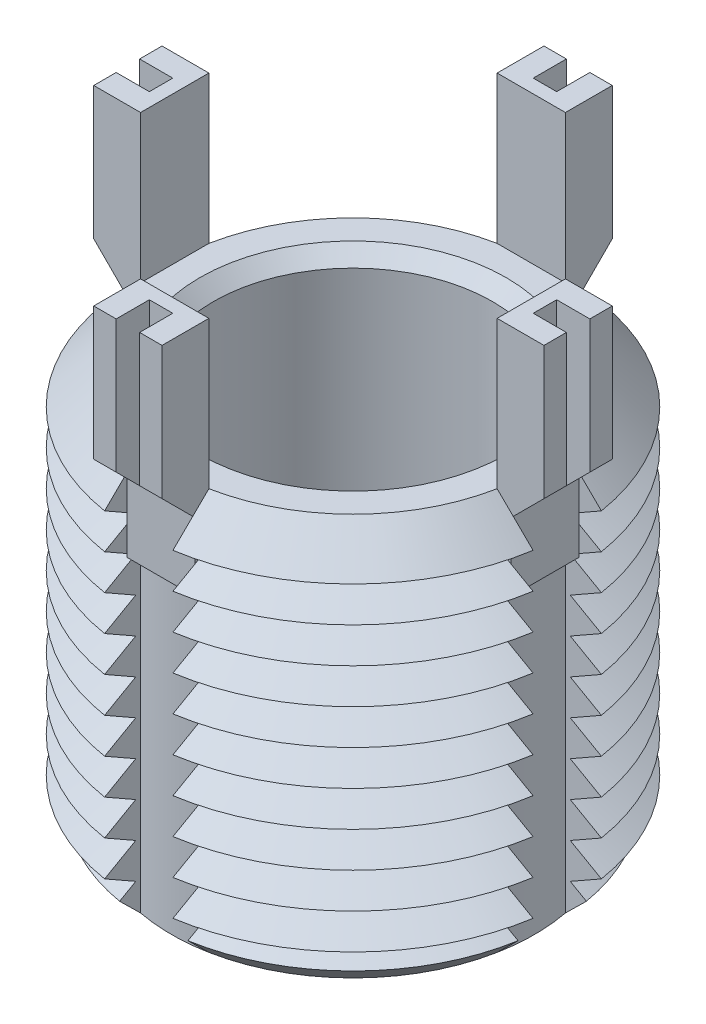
from build123d import *

# Parameters (mm, degrees)
SKETCH1_R               = 11.1125
BOSS_EXTRUDE1_DEPTH     = 20.574
CHAMFER1_SIZE           = 1.814
LPATTERN1_COUNT         = 10
LPATTERN1_PITCH         = 1.814
CUT_EXTRUDE1_REACH      = 27.889
CIRPATTERN1_COUNT       = 4
BOSS_EXTRUDE3_DEPTH     = 1.75
CIRPATTERN2_COUNT       = 4
CUT_EXTRUDE3_DEPTH      = 33.517673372
CUT_EXTRUDE3_DEPTH_BACK = 33.517673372
SKETCH6_W               = 1.7
SKETCH6_H               = 1.2
SKETCH6_W_2             = 1.2
SKETCH6_H_2             = 1.7
SKETCH7_R               = 7.144
CUT_EXTRUDE4_DEPTH      = 20.574
CHAMFER2_SIZE           = 0.7055


with BuildPart() as part:
    # Sketch1 → Boss-Extrude1 (new body)
    with BuildSketch(Plane(origin=(0, 0, 0), x_dir=(1, 0, 0), z_dir=(0, 1, 0))):
        with Locations(Location((0, 0, 0), (0, 0, 270))):
            Circle(SKETCH1_R)
    extrude(amount=-BOSS_EXTRUDE1_DEPTH)

    # Chamfer1
    chamfer1_edges = [part.edges().sort_by_distance(p)[0] for p in [
        (0, 0, -11.1125),
        (0, -20.574, -11.1125),
    ]]
    chamfer(chamfer1_edges, length=CHAMFER1_SIZE)

    # Sketch3 → Cut-Revolve1 (revolve, cut)
    with BuildSketch(Plane(origin=(0, 0, 0), x_dir=(0, 0, -1), z_dir=(1, 0, 0))):
        Polygon((-11.1125, -1.814), (-9.541529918, -2.721), (-11.1125, -3.628), align=None)
    cut_revolve1 = revolve(axis=Axis((0, 0.885892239, 0), (0, -1, 0)), mode=Mode.SUBTRACT)

    # LPattern1: Cut-Revolve1 ×10
    with Locations(*[(0, -i * LPATTERN1_PITCH, 0) for i in range(1, LPATTERN1_COUNT)]):
        add(cut_revolve1, mode=Mode.SUBTRACT)

    # Cut-Extrude1: up to this cone (the profile starts inside it)
    cut_extrude1_end = Plane(origin=(0, 0, 0), z_dir=(0, 1, 0)).offset(-29.872499) * Cone(1e-06, 88.134, 88.133999, align=(Align.CENTER, Align.CENTER, Align.MIN), mode=Mode.PRIVATE)
    # Sketch4 → Cut-Extrude1 (cut, up to the surface)
    with BuildSketch(Plane(origin=(0, 0, 0), x_dir=(1, 0, 0), z_dir=(0, 1, 0)), mode=Mode.PRIVATE) as cut_extrude1_sk1:
        with BuildLine():
            Line((-9.132338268, 1.75), (-10.973839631, 1.75))
            ThreePointArc((-10.973839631, 1.75), (-11.1125, 0), (-10.973839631, -1.75))
            Line((-10.973839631, -1.75), (-9.132338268, -1.75))
            ThreePointArc((-9.132338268, -1.75), (-9.2985, 0), (-9.132338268, 1.75))
        make_face()
    cut_extrude1_tool1 = extrude(cut_extrude1_sk1.sketch, amount=-CUT_EXTRUDE1_REACH, mode=Mode.PRIVATE) & cut_extrude1_end
    cut_extrude1 = cut_extrude1_tool1.solids().sort_by_distance((-10.154651, 0, 0))[0]
    add(cut_extrude1, mode=Mode.SUBTRACT)

    # CirPattern1: Cut-Extrude1 ×4 about axis
    cirpattern1_axis = Axis((0, 0, 0), (0, 1, 0))
    for i in range(1, CIRPATTERN1_COUNT):
        add(cut_extrude1.rotate(cirpattern1_axis, i * 360 / CIRPATTERN1_COUNT), mode=Mode.SUBTRACT)

    # Sketch5 → Boss-Extrude3 (add, symmetric)
    with BuildSketch(Plane(origin=(0, 0, 0), x_dir=(0, 0, -1), z_dir=(1, 0, 0))):
        Polygon((-9.132338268, 7.558), (-9.132338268, -4.442), (-9.832338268, -4.442), (-9.832338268, -0.942), (-11.532338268, 0.758), (-11.532338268, 7.558), align=None)
    boss_extrude3 = extrude(amount=BOSS_EXTRUDE3_DEPTH, both=True)

    # CirPattern2: Boss-Extrude3 ×4 about axis
    cirpattern2_axis = Axis((0, 0, 0), (0, 1, 0))
    for i in range(1, CIRPATTERN2_COUNT):
        add(boss_extrude3.rotate(cirpattern2_axis, i * 360 / CIRPATTERN2_COUNT))

    # Sketch6 → Cut-Extrude3 (cut, two sides: drawn at the far end of the back side and taken through both)
    with BuildSketch(Plane(origin=(0, 7.558, 0), x_dir=(1, 0, 0), z_dir=(0, 1, 0)).offset(-CUT_EXTRUDE3_DEPTH_BACK)):
        with Locations((-10.682338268, 0)):
            Rectangle(SKETCH6_W, SKETCH6_H)
        with Locations((0, 10.682338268)):
            Rectangle(SKETCH6_W_2, SKETCH6_H_2)
        with Locations((10.682338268, 0)):
            Rectangle(SKETCH6_W, SKETCH6_H)
        with Locations((0, -10.682338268)):
            Rectangle(SKETCH6_W_2, SKETCH6_H_2)
    extrude(amount=CUT_EXTRUDE3_DEPTH + CUT_EXTRUDE3_DEPTH_BACK, mode=Mode.SUBTRACT)

    # Sketch7 → Cut-Extrude4 (cut)
    with BuildSketch(Plane(origin=(0, 0, 0), x_dir=(1, 0, 0), z_dir=(0, 1, 0))):
        with Locations(Location((0, 0, 0), (0, 0, 270))):
            Circle(SKETCH7_R)
    extrude(amount=-CUT_EXTRUDE4_DEPTH, mode=Mode.SUBTRACT)

    # Chamfer2
    chamfer2_edges = [part.edges().sort_by_distance(p)[0] for p in [
        (0, 0, -7.144),
        (0, -20.574, -7.144),
    ]]
    chamfer(chamfer2_edges, length=CHAMFER2_SIZE)


solid = part.part
